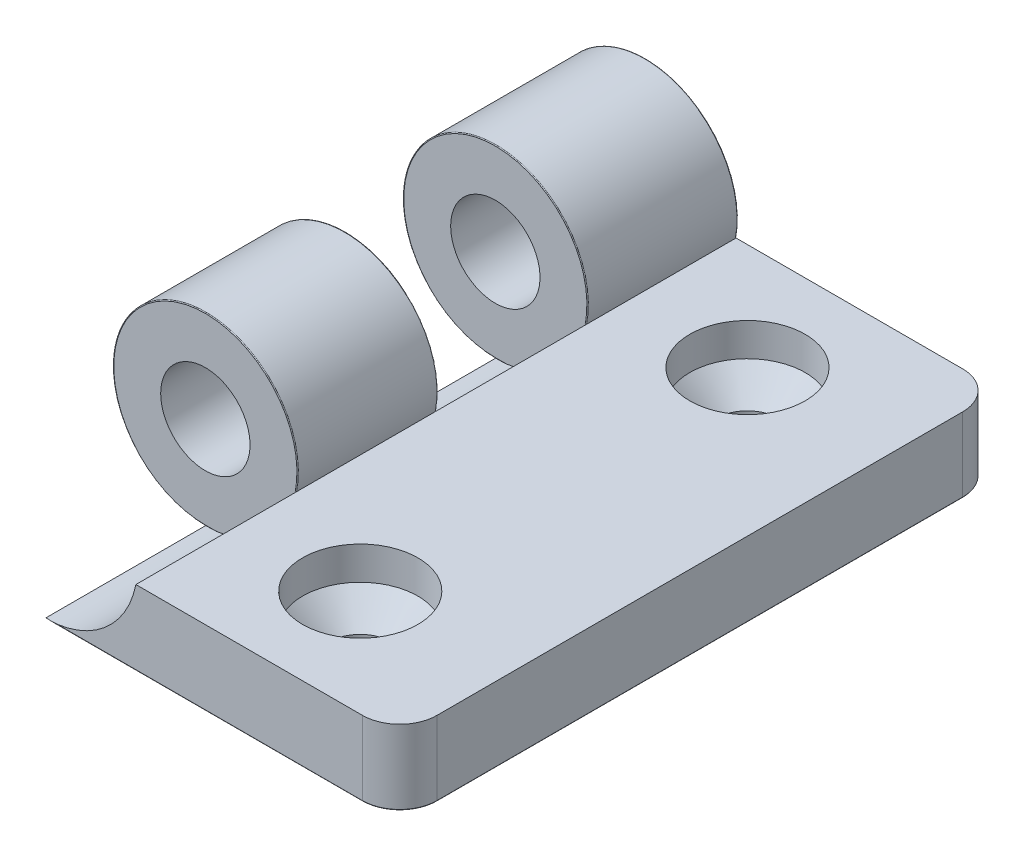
ISO-10303-21;
HEADER;
FILE_DESCRIPTION(('STEP AP214'),'2;1');
FILE_NAME('part.step','',(''),(''),'','','');
FILE_SCHEMA(('AUTOMOTIVE_DESIGN { 1 0 10303 214 1 1 1 1 }'));
ENDSEC;
DATA;
#1=APPLICATION_CONTEXT('core data for automotive mechanical design processes');
#2=APPLICATION_PROTOCOL_DEFINITION('international standard','automotive_design',2000,#1);
#3=PRODUCT_CONTEXT('',#1,'mechanical');
#4=PRODUCT('Part','Part','',(#3));
#5=PRODUCT_RELATED_PRODUCT_CATEGORY('part','',(#4));
#6=PRODUCT_DEFINITION_FORMATION('','',#4);
#7=PRODUCT_DEFINITION_CONTEXT('part definition',#1,'design');
#8=PRODUCT_DEFINITION('design','',#6,#7);
#9=PRODUCT_DEFINITION_SHAPE('','',#8);
#10=(LENGTH_UNIT() NAMED_UNIT(*) SI_UNIT(.MILLI.,.METRE.));
#11=(NAMED_UNIT(*) PLANE_ANGLE_UNIT() SI_UNIT($,.RADIAN.));
#12=(NAMED_UNIT(*) SI_UNIT($,.STERADIAN.) SOLID_ANGLE_UNIT());
#13=UNCERTAINTY_MEASURE_WITH_UNIT(LENGTH_MEASURE(1.E-05),#10,'distance_accuracy_value','');
#14=(GEOMETRIC_REPRESENTATION_CONTEXT(3) GLOBAL_UNCERTAINTY_ASSIGNED_CONTEXT((#13)) GLOBAL_UNIT_ASSIGNED_CONTEXT((#10,
#11,#12)) REPRESENTATION_CONTEXT('',''));
#15=CARTESIAN_POINT('',(0.,0.,0.));
#16=DIRECTION('',(0.,0.,1.));
#17=DIRECTION('',(1.,0.,0.));
#18=AXIS2_PLACEMENT_3D('',#15,#16,#17);
#19=CARTESIAN_POINT('',(0.,0.,40.3));
#20=DIRECTION('',(0.,0.,-1.));
#21=DIRECTION('',(-1.,0.,0.));
#22=AXIS2_PLACEMENT_3D('',#19,#20,#21);
#23=CYLINDRICAL_SURFACE('',#22,6.2);
#24=DIRECTION('',(0.,0.,-1.));
#25=VECTOR('',#24,1.);
#26=CARTESIAN_POINT('',(6.08276253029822,-1.2,40.3));
#27=LINE('',#26,#25);
#28=CARTESIAN_POINT('',(6.08276253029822,-1.2,20.2));
#29=VERTEX_POINT('',#28);
#30=CARTESIAN_POINT('',(6.08276253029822,-1.2,29.5));
#31=VERTEX_POINT('',#30);
#32=EDGE_CURVE('E235',#29,#31,#27,.F.);
#33=ORIENTED_EDGE('',*,*,#32,.F.);
#34=CARTESIAN_POINT('',(0.,0.,20.2));
#35=DIRECTION('',(0.,0.,-1.));
#36=DIRECTION('',(-1.,0.,0.));
#37=AXIS2_PLACEMENT_3D('',#34,#35,#36);
#38=CIRCLE('',#37,6.2);
#39=CARTESIAN_POINT('',(0.,-6.2,20.2));
#40=VERTEX_POINT('',#39);
#41=EDGE_CURVE('E477',#29,#40,#38,.F.);
#42=ORIENTED_EDGE('',*,*,#41,.T.);
#43=DIRECTION('',(0.,0.,-1.));
#44=VECTOR('',#43,1.);
#45=CARTESIAN_POINT('',(0.,-6.2,40.3));
#46=LINE('',#45,#44);
#47=CARTESIAN_POINT('',(0.,-6.2,29.5));
#48=VERTEX_POINT('',#47);
#49=EDGE_CURVE('E236',#48,#40,#46,.T.);
#50=ORIENTED_EDGE('',*,*,#49,.F.);
#51=CARTESIAN_POINT('',(0.,0.,29.5));
#52=DIRECTION('',(0.,0.,-1.));
#53=DIRECTION('',(-1.,0.,0.));
#54=AXIS2_PLACEMENT_3D('',#51,#52,#53);
#55=CIRCLE('',#54,6.2);
#56=EDGE_CURVE('E268',#48,#31,#55,.T.);
#57=ORIENTED_EDGE('',*,*,#56,.T.);
#58=EDGE_LOOP('',(#33,#42,#50,#57));
#59=FACE_BOUND('',#58,.T.);
#60=ADVANCED_FACE('F36',(#59),#23,.T.);
#61=CARTESIAN_POINT('',(0.,0.,40.3));
#62=DIRECTION('',(0.,0.,-1.));
#63=DIRECTION('',(-1.,0.,0.));
#64=AXIS2_PLACEMENT_3D('',#61,#62,#63);
#65=CYLINDRICAL_SURFACE('',#64,3.);
#66=CARTESIAN_POINT('',(0.,0.,29.55));
#67=DIRECTION('',(0.,0.,-1.));
#68=DIRECTION('',(-1.,0.,0.));
#69=AXIS2_PLACEMENT_3D('',#66,#67,#68);
#70=CIRCLE('',#69,3.);
#71=CARTESIAN_POINT('',(-3.,0.,29.55));
#72=VERTEX_POINT('',#71);
#73=EDGE_CURVE('E206',#72,#72,#70,.T.);
#74=ORIENTED_EDGE('',*,*,#73,.F.);
#75=EDGE_LOOP('',(#74));
#76=FACE_BOUND('',#75,.T.);
#77=CARTESIAN_POINT('',(0.,0.,20.15));
#78=DIRECTION('',(0.,0.,-1.));
#79=DIRECTION('',(-1.,0.,0.));
#80=AXIS2_PLACEMENT_3D('',#77,#78,#79);
#81=CIRCLE('',#80,3.);
#82=CARTESIAN_POINT('',(-3.,0.,20.15));
#83=VERTEX_POINT('',#82);
#84=EDGE_CURVE('E201',#83,#83,#81,.T.);
#85=ORIENTED_EDGE('',*,*,#84,.T.);
#86=EDGE_LOOP('',(#85));
#87=FACE_BOUND('',#86,.T.);
#88=ADVANCED_FACE('F409',(#76,#87),#65,.F.);
#89=CARTESIAN_POINT('',(0.,0.,40.3));
#90=DIRECTION('',(0.,0.,1.));
#91=DIRECTION('',(1.,0.,0.));
#92=AXIS2_PLACEMENT_3D('',#89,#90,#91);
#93=PLANE('',#92);
#94=CARTESIAN_POINT('',(0.,0.,40.3));
#95=DIRECTION('',(0.,0.,-1.));
#96=DIRECTION('',(-1.,0.,0.));
#97=AXIS2_PLACEMENT_3D('',#94,#95,#96);
#98=CIRCLE('',#97,6.2);
#99=CARTESIAN_POINT('',(6.08276253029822,-1.2,40.3));
#100=VERTEX_POINT('',#99);
#101=CARTESIAN_POINT('',(0.785811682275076,-6.15,40.3));
#102=VERTEX_POINT('',#101);
#103=EDGE_CURVE('E194',#100,#102,#98,.T.);
#104=ORIENTED_EDGE('',*,*,#103,.T.);
#105=DIRECTION('',(1.,0.,0.));
#106=VECTOR('',#105,1.);
#107=CARTESIAN_POINT('',(21.3,-6.15,40.3));
#108=LINE('',#107,#106);
#109=CARTESIAN_POINT('',(21.3,-6.15,40.3));
#110=VERTEX_POINT('',#109);
#111=EDGE_CURVE('E343',#102,#110,#108,.T.);
#112=ORIENTED_EDGE('',*,*,#111,.T.);
#113=DIRECTION('',(0.,1.,0.));
#114=VECTOR('',#113,1.);
#115=CARTESIAN_POINT('',(21.3,-1.2,40.3));
#116=LINE('',#115,#114);
#117=CARTESIAN_POINT('',(21.3,-1.2,40.3));
#118=VERTEX_POINT('',#117);
#119=EDGE_CURVE('E255',#110,#118,#116,.T.);
#120=ORIENTED_EDGE('',*,*,#119,.T.);
#121=DIRECTION('',(-1.,0.,0.));
#122=VECTOR('',#121,1.);
#123=CARTESIAN_POINT('',(0.,-1.2,40.3));
#124=LINE('',#123,#122);
#125=EDGE_CURVE('E226',#118,#100,#124,.T.);
#126=ORIENTED_EDGE('',*,*,#125,.T.);
#127=EDGE_LOOP('',(#104,#112,#120,#126));
#128=FACE_BOUND('',#127,.T.);
#129=ADVANCED_FACE('F418',(#128),#93,.T.);
#130=CARTESIAN_POINT('',(0.,0.,0.));
#131=DIRECTION('',(0.,0.,1.));
#132=DIRECTION('',(1.,0.,0.));
#133=AXIS2_PLACEMENT_3D('',#130,#131,#132);
#134=PLANE('',#133);
#135=DIRECTION('',(0.,1.,0.));
#136=VECTOR('',#135,1.);
#137=CARTESIAN_POINT('',(21.3,0.,0.));
#138=LINE('',#137,#136);
#139=CARTESIAN_POINT('',(21.3,-1.2,0.));
#140=VERTEX_POINT('',#139);
#141=CARTESIAN_POINT('',(21.3,-6.15,0.));
#142=VERTEX_POINT('',#141);
#143=EDGE_CURVE('E266',#140,#142,#138,.F.);
#144=ORIENTED_EDGE('',*,*,#143,.T.);
#145=DIRECTION('',(1.,0.,0.));
#146=VECTOR('',#145,1.);
#147=CARTESIAN_POINT('',(0.,-6.15,0.));
#148=LINE('',#147,#146);
#149=CARTESIAN_POINT('',(0.,-6.15,0.));
#150=VERTEX_POINT('',#149);
#151=EDGE_CURVE('E60',#142,#150,#148,.F.);
#152=ORIENTED_EDGE('',*,*,#151,.T.);
#153=CARTESIAN_POINT('',(0.,0.,0.));
#154=DIRECTION('',(0.,0.,1.));
#155=DIRECTION('',(1.,0.,0.));
#156=AXIS2_PLACEMENT_3D('',#153,#154,#155);
#157=CIRCLE('',#156,6.15);
#158=CARTESIAN_POINT('',(6.03179077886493,-1.2,0.));
#159=VERTEX_POINT('',#158);
#160=EDGE_CURVE('E445',#150,#159,#157,.F.);
#161=ORIENTED_EDGE('',*,*,#160,.T.);
#162=DIRECTION('',(-1.,0.,0.));
#163=VECTOR('',#162,1.);
#164=CARTESIAN_POINT('',(0.,-1.2,0.));
#165=LINE('',#164,#163);
#166=EDGE_CURVE('E225',#140,#159,#165,.T.);
#167=ORIENTED_EDGE('',*,*,#166,.F.);
#168=EDGE_LOOP('',(#144,#152,#161,#167));
#169=FACE_BOUND('',#168,.T.);
#170=CARTESIAN_POINT('',(0.,0.,0.));
#171=DIRECTION('',(0.,0.,1.));
#172=DIRECTION('',(1.,0.,0.));
#173=AXIS2_PLACEMENT_3D('',#170,#171,#172);
#174=CIRCLE('',#173,3.);
#175=CARTESIAN_POINT('',(3.,0.,0.));
#176=VERTEX_POINT('',#175);
#177=EDGE_CURVE('E240',#176,#176,#174,.T.);
#178=ORIENTED_EDGE('',*,*,#177,.T.);
#179=EDGE_LOOP('',(#178));
#180=FACE_BOUND('',#179,.T.);
#181=ADVANCED_FACE('F426',(#169,#180),#134,.F.);
#182=CARTESIAN_POINT('',(6.08276253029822,-1.2,0.0500000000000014));
#183=VERTEX_POINT('',#182);
#184=CARTESIAN_POINT('',(6.08276253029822,-1.2,10.03));
#185=VERTEX_POINT('',#184);
#186=EDGE_CURVE('E238',#183,#185,#27,.F.);
#187=ORIENTED_EDGE('',*,*,#186,.F.);
#188=CARTESIAN_POINT('',(0.,0.,0.0500000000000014));
#189=DIRECTION('',(0.,0.,1.));
#190=DIRECTION('',(1.,0.,0.));
#191=AXIS2_PLACEMENT_3D('',#188,#189,#190);
#192=CIRCLE('',#191,6.2);
#193=CARTESIAN_POINT('',(0.,-6.2,0.0500000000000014));
#194=VERTEX_POINT('',#193);
#195=EDGE_CURVE('E46',#183,#194,#192,.T.);
#196=ORIENTED_EDGE('',*,*,#195,.T.);
#197=CARTESIAN_POINT('',(0.,-6.2,10.03));
#198=VERTEX_POINT('',#197);
#199=EDGE_CURVE('E232',#198,#194,#46,.T.);
#200=ORIENTED_EDGE('',*,*,#199,.F.);
#201=CARTESIAN_POINT('',(0.,0.,10.03));
#202=DIRECTION('',(0.,0.,-1.));
#203=DIRECTION('',(-1.,0.,0.));
#204=AXIS2_PLACEMENT_3D('',#201,#202,#203);
#205=CIRCLE('',#204,6.2);
#206=EDGE_CURVE('E319',#198,#185,#205,.T.);
#207=ORIENTED_EDGE('',*,*,#206,.T.);
#208=EDGE_LOOP('',(#187,#196,#200,#207));
#209=FACE_BOUND('',#208,.T.);
#210=ADVANCED_FACE('F412',(#209),#23,.T.);
#211=CARTESIAN_POINT('',(0.,0.,10.08));
#212=DIRECTION('',(0.,0.,-1.));
#213=DIRECTION('',(-1.,0.,0.));
#214=AXIS2_PLACEMENT_3D('',#211,#212,#213);
#215=CIRCLE('',#214,3.);
#216=CARTESIAN_POINT('',(-3.,0.,10.08));
#217=VERTEX_POINT('',#216);
#218=EDGE_CURVE('E195',#217,#217,#215,.T.);
#219=ORIENTED_EDGE('',*,*,#218,.F.);
#220=EDGE_LOOP('',(#219));
#221=FACE_BOUND('',#220,.T.);
#222=ORIENTED_EDGE('',*,*,#177,.F.);
#223=EDGE_LOOP('',(#222));
#224=FACE_BOUND('',#223,.T.);
#225=ADVANCED_FACE('F421',(#221,#224),#65,.F.);
#226=CARTESIAN_POINT('',(0.,-1.2,40.3));
#227=DIRECTION('',(0.,-1.,0.));
#228=DIRECTION('',(0.,0.,-1.));
#229=AXIS2_PLACEMENT_3D('',#226,#227,#228);
#230=PLANE('',#229);
#231=CARTESIAN_POINT('',(14.,-1.2,33.15));
#232=DIRECTION('',(0.,1.,0.));
#233=DIRECTION('',(0.,0.,1.));
#234=AXIS2_PLACEMENT_3D('',#231,#232,#233);
#235=CIRCLE('',#234,3.875);
#236=CARTESIAN_POINT('',(14.,-1.2,37.025));
#237=VERTEX_POINT('',#236);
#238=EDGE_CURVE('E219',#237,#237,#235,.T.);
#239=ORIENTED_EDGE('',*,*,#238,.F.);
#240=EDGE_LOOP('',(#239));
#241=FACE_BOUND('',#240,.T.);
#242=CARTESIAN_POINT('',(14.,-1.2,7.15));
#243=DIRECTION('',(0.,1.,0.));
#244=DIRECTION('',(0.,0.,1.));
#245=AXIS2_PLACEMENT_3D('',#242,#243,#244);
#246=CIRCLE('',#245,3.875);
#247=CARTESIAN_POINT('',(14.,-1.2,11.025));
#248=VERTEX_POINT('',#247);
#249=EDGE_CURVE('E222',#248,#248,#246,.T.);
#250=ORIENTED_EDGE('',*,*,#249,.F.);
#251=EDGE_LOOP('',(#250));
#252=FACE_BOUND('',#251,.T.);
#253=DIRECTION('',(0.,0.,-1.));
#254=VECTOR('',#253,1.);
#255=CARTESIAN_POINT('',(23.8,-1.2,40.3));
#256=LINE('',#255,#254);
#257=CARTESIAN_POINT('',(23.8,-1.2,37.8));
#258=VERTEX_POINT('',#257);
#259=CARTESIAN_POINT('',(23.8,-1.2,2.5));
#260=VERTEX_POINT('',#259);
#261=EDGE_CURVE('E229',#258,#260,#256,.T.);
#262=ORIENTED_EDGE('',*,*,#261,.T.);
#263=CARTESIAN_POINT('',(21.3,-1.2,2.5));
#264=DIRECTION('',(0.,-1.,0.));
#265=DIRECTION('',(0.,0.,-1.));
#266=AXIS2_PLACEMENT_3D('',#263,#264,#265);
#267=CIRCLE('',#266,2.5);
#268=EDGE_CURVE('E264',#260,#140,#267,.F.);
#269=ORIENTED_EDGE('',*,*,#268,.T.);
#270=ORIENTED_EDGE('',*,*,#166,.T.);
#271=CARTESIAN_POINT('',(6.03179077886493,-1.2,0.));
#272=CARTESIAN_POINT('',(6.03469958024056,-1.2,-2.20087831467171E-06));
#273=CARTESIAN_POINT('',(6.03760800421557,-1.2,0.000244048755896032));
#274=CARTESIAN_POINT('',(6.04334260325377,-1.2,0.00121770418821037));
#275=CARTESIAN_POINT('',(6.04616879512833,-1.2,0.00194501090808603));
#276=CARTESIAN_POINT('',(6.05166056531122,-1.2,0.00386569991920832));
#277=CARTESIAN_POINT('',(6.05432603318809,-1.2,0.00505939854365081));
#278=CARTESIAN_POINT('',(6.05941543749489,-1.2,0.00788089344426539));
#279=CARTESIAN_POINT('',(6.06183945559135,-1.2,0.00950854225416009));
#280=CARTESIAN_POINT('',(6.06635276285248,-1.2,0.0131378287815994));
#281=CARTESIAN_POINT('',(6.06844491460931,-1.2,0.0151359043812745));
#282=CARTESIAN_POINT('',(6.07225690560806,-1.2,0.0194613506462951));
#283=CARTESIAN_POINT('',(6.07397668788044,-1.2,0.0217887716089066));
#284=CARTESIAN_POINT('',(6.07696092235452,-1.2,0.0266607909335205));
#285=CARTESIAN_POINT('',(6.07823307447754,-1.2,0.0292006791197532));
#286=CARTESIAN_POINT('',(6.08032363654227,-1.2,0.0344597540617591));
#287=CARTESIAN_POINT('',(6.0811424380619,-1.2,0.0371787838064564));
#288=CARTESIAN_POINT('',(6.08206759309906,-1.2,0.0415992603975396));
#289=CARTESIAN_POINT('',(6.0823280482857,-1.2,0.0432699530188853));
#290=CARTESIAN_POINT('',(6.08267546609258,-1.2,0.0466268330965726));
#291=CARTESIAN_POINT('',(6.08276267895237,-1.2,0.0483129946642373));
#292=CARTESIAN_POINT('',(6.08276253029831,-1.2,0.0499999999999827));
#293=B_SPLINE_CURVE_WITH_KNOTS('',3,(#271,#272,#273,#274,#275,#276,#277,#278,#279,#280,#281,
#282,#283,#284,#285,#286,#287,#288,#289,#290,#291,#292),.UNSPECIFIED.,.F.,.F.,(4,2,2,2,2,2,2,2,
2,2,4),(0.,0.00871552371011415,0.0174292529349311,0.0261489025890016,0.0348655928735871,
0.0435024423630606,0.0521406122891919,0.0606219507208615,0.0690959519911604,0.0741603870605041,
0.0792175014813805),.UNSPECIFIED.);
#294=EDGE_CURVE('E11',#159,#183,#293,.T.);
#295=ORIENTED_EDGE('',*,*,#294,.T.);
#296=ORIENTED_EDGE('',*,*,#186,.T.);
#297=CARTESIAN_POINT('',(6.08276253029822,-1.2,10.03));
#298=CARTESIAN_POINT('',(6.08276513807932,-1.2,10.0327743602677));
#299=CARTESIAN_POINT('',(6.08252733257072,-1.2,10.0355476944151));
#300=CARTESIAN_POINT('',(6.08159051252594,-1.2,10.0410117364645));
#301=CARTESIAN_POINT('',(6.08089210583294,-1.2,10.043702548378));
#302=CARTESIAN_POINT('',(6.0790533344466,-1.2,10.0489294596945));
#303=CARTESIAN_POINT('',(6.07791283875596,-1.2,10.0514655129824));
#304=CARTESIAN_POINT('',(6.07522590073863,-1.2,10.0563121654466));
#305=CARTESIAN_POINT('',(6.07367946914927,-1.2,10.058622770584));
#306=CARTESIAN_POINT('',(6.07021241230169,-1.2,10.0629746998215));
#307=CARTESIAN_POINT('',(6.06828882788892,-1.2,10.0650136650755));
#308=CARTESIAN_POINT('',(6.06413169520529,-1.2,10.0687469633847));
#309=CARTESIAN_POINT('',(6.06189807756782,-1.2,10.0704412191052));
#310=CARTESIAN_POINT('',(6.05714176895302,-1.2,10.0734692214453));
#311=CARTESIAN_POINT('',(6.05461458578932,-1.2,10.0747959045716));
#312=CARTESIAN_POINT('',(6.04937629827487,-1.2,10.0770139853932));
#313=CARTESIAN_POINT('',(6.04666525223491,-1.2,10.077905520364));
#314=CARTESIAN_POINT('',(6.04191818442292,-1.2,10.0790443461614));
#315=CARTESIAN_POINT('',(6.03990799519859,-1.2,10.0794025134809));
#316=CARTESIAN_POINT('',(6.03586235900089,-1.2,10.0798803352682));
#317=CARTESIAN_POINT('',(6.03382695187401,-1.2,10.0800003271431));
#318=CARTESIAN_POINT('',(6.03179077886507,-1.2,10.0800000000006));
#319=B_SPLINE_CURVE_WITH_KNOTS('',3,(#297,#298,#299,#300,#301,#302,#303,#304,#305,#306,#307,
#308,#309,#310,#311,#312,#313,#314,#315,#316,#317,#318),.UNSPECIFIED.,.F.,.F.,(4,2,2,2,2,2,2,2,
2,2,4),(0.,0.00831137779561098,0.0166118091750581,0.0249147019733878,0.0332173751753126,
0.0415880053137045,0.049960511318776,0.0584842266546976,0.0670052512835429,0.0731174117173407,
0.0792209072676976),.UNSPECIFIED.);
#320=CARTESIAN_POINT('',(6.03179077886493,-1.2,10.08));
#321=VERTEX_POINT('',#320);
#322=EDGE_CURVE('E344',#185,#321,#319,.T.);
#323=ORIENTED_EDGE('',*,*,#322,.T.);
#324=DIRECTION('',(-1.,0.,0.));
#325=VECTOR('',#324,1.);
#326=CARTESIAN_POINT('',(0.,-1.2,10.08));
#327=LINE('',#326,#325);
#328=CARTESIAN_POINT('',(6.08276253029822,-1.2,10.08));
#329=VERTEX_POINT('',#328);
#330=EDGE_CURVE('E192',#329,#321,#327,.T.);
#331=ORIENTED_EDGE('',*,*,#330,.F.);
#332=DIRECTION('',(0.,0.,1.));
#333=VECTOR('',#332,1.);
#334=CARTESIAN_POINT('',(6.08276253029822,-1.2,10.08));
#335=LINE('',#334,#333);
#336=CARTESIAN_POINT('',(6.08276253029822,-1.2,20.15));
#337=VERTEX_POINT('',#336);
#338=EDGE_CURVE('E183',#337,#329,#335,.F.);
#339=ORIENTED_EDGE('',*,*,#338,.F.);
#340=DIRECTION('',(1.,0.,0.));
#341=VECTOR('',#340,1.);
#342=CARTESIAN_POINT('',(0.,-1.2,20.15));
#343=LINE('',#342,#341);
#344=CARTESIAN_POINT('',(6.03179077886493,-1.2,20.15));
#345=VERTEX_POINT('',#344);
#346=EDGE_CURVE('E167',#345,#337,#343,.T.);
#347=ORIENTED_EDGE('',*,*,#346,.F.);
#348=CARTESIAN_POINT('',(6.03179077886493,-1.2,20.15));
#349=CARTESIAN_POINT('',(6.03469958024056,-1.2,20.1499977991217));
#350=CARTESIAN_POINT('',(6.03760800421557,-1.2,20.1502440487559));
#351=CARTESIAN_POINT('',(6.04334260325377,-1.2,20.1512177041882));
#352=CARTESIAN_POINT('',(6.04616879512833,-1.2,20.1519450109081));
#353=CARTESIAN_POINT('',(6.05166056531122,-1.2,20.1538656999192));
#354=CARTESIAN_POINT('',(6.05432603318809,-1.2,20.1550593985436));
#355=CARTESIAN_POINT('',(6.05941543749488,-1.2,20.1578808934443));
#356=CARTESIAN_POINT('',(6.06183945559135,-1.2,20.1595085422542));
#357=CARTESIAN_POINT('',(6.06635276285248,-1.2,20.1631378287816));
#358=CARTESIAN_POINT('',(6.0684449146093,-1.2,20.1651359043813));
#359=CARTESIAN_POINT('',(6.07225690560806,-1.2,20.1694613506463));
#360=CARTESIAN_POINT('',(6.07397668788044,-1.2,20.1717887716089));
#361=CARTESIAN_POINT('',(6.07696092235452,-1.2,20.1766607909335));
#362=CARTESIAN_POINT('',(6.07823307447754,-1.2,20.1792006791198));
#363=CARTESIAN_POINT('',(6.08032363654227,-1.2,20.1844597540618));
#364=CARTESIAN_POINT('',(6.0811424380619,-1.2,20.1871787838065));
#365=CARTESIAN_POINT('',(6.08206759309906,-1.2,20.1915992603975));
#366=CARTESIAN_POINT('',(6.0823280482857,-1.2,20.1932699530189));
#367=CARTESIAN_POINT('',(6.08267546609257,-1.2,20.1966268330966));
#368=CARTESIAN_POINT('',(6.08276267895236,-1.2,20.1983129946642));
#369=CARTESIAN_POINT('',(6.08276253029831,-1.2,20.2));
#370=B_SPLINE_CURVE_WITH_KNOTS('',3,(#348,#349,#350,#351,#352,#353,#354,#355,#356,#357,#358,
#359,#360,#361,#362,#363,#364,#365,#366,#367,#368,#369),.UNSPECIFIED.,.F.,.F.,(4,2,2,2,2,2,2,2,
2,2,4),(0.,0.00871552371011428,0.0174292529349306,0.0261489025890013,0.0348655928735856,
0.0435024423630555,0.0521406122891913,0.0606219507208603,0.0690959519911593,0.0741603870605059,
0.0792175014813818),.UNSPECIFIED.);
#371=EDGE_CURVE('E320',#345,#29,#370,.T.);
#372=ORIENTED_EDGE('',*,*,#371,.T.);
#373=ORIENTED_EDGE('',*,*,#32,.T.);
#374=CARTESIAN_POINT('',(6.08276253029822,-1.2,29.5));
#375=CARTESIAN_POINT('',(6.08276513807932,-1.2,29.5027743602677));
#376=CARTESIAN_POINT('',(6.08252733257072,-1.2,29.5055476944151));
#377=CARTESIAN_POINT('',(6.08159051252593,-1.2,29.5110117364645));
#378=CARTESIAN_POINT('',(6.08089210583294,-1.2,29.513702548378));
#379=CARTESIAN_POINT('',(6.0790533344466,-1.2,29.5189294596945));
#380=CARTESIAN_POINT('',(6.07791283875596,-1.2,29.5214655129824));
#381=CARTESIAN_POINT('',(6.07522590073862,-1.2,29.5263121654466));
#382=CARTESIAN_POINT('',(6.07367946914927,-1.2,29.528622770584));
#383=CARTESIAN_POINT('',(6.07021241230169,-1.2,29.5329746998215));
#384=CARTESIAN_POINT('',(6.06828882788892,-1.2,29.5350136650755));
#385=CARTESIAN_POINT('',(6.06413169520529,-1.2,29.5387469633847));
#386=CARTESIAN_POINT('',(6.06189807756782,-1.2,29.5404412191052));
#387=CARTESIAN_POINT('',(6.05714176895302,-1.2,29.5434692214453));
#388=CARTESIAN_POINT('',(6.05461458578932,-1.2,29.5447959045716));
#389=CARTESIAN_POINT('',(6.04937629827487,-1.2,29.5470139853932));
#390=CARTESIAN_POINT('',(6.04666525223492,-1.2,29.547905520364));
#391=CARTESIAN_POINT('',(6.04191818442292,-1.2,29.5490443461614));
#392=CARTESIAN_POINT('',(6.03990799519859,-1.2,29.5494025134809));
#393=CARTESIAN_POINT('',(6.03586235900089,-1.2,29.5498803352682));
#394=CARTESIAN_POINT('',(6.033826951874,-1.2,29.5500003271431));
#395=CARTESIAN_POINT('',(6.03179077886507,-1.2,29.5500000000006));
#396=B_SPLINE_CURVE_WITH_KNOTS('',3,(#374,#375,#376,#377,#378,#379,#380,#381,#382,#383,#384,
#385,#386,#387,#388,#389,#390,#391,#392,#393,#394,#395),.UNSPECIFIED.,.F.,.F.,(4,2,2,2,2,2,2,2,
2,2,4),(0.,0.00831137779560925,0.016611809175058,0.0249147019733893,0.0332173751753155,
0.0415880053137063,0.0499605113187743,0.058484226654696,0.0670052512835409,0.0731174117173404,
0.0792209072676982),.UNSPECIFIED.);
#397=CARTESIAN_POINT('',(6.03179077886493,-1.2,29.55));
#398=VERTEX_POINT('',#397);
#399=EDGE_CURVE('E279',#31,#398,#396,.T.);
#400=ORIENTED_EDGE('',*,*,#399,.T.);
#401=DIRECTION('',(-1.,0.,0.));
#402=VECTOR('',#401,1.);
#403=CARTESIAN_POINT('',(0.,-1.2,29.55));
#404=LINE('',#403,#402);
#405=CARTESIAN_POINT('',(6.08276253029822,-1.2,29.55));
#406=VERTEX_POINT('',#405);
#407=EDGE_CURVE('E276',#406,#398,#404,.T.);
#408=ORIENTED_EDGE('',*,*,#407,.F.);
#409=DIRECTION('',(0.,0.,1.));
#410=VECTOR('',#409,1.);
#411=CARTESIAN_POINT('',(6.08276253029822,-1.2,29.55));
#412=LINE('',#411,#410);
#413=EDGE_CURVE('E210',#100,#406,#412,.F.);
#414=ORIENTED_EDGE('',*,*,#413,.F.);
#415=ORIENTED_EDGE('',*,*,#125,.F.);
#416=CARTESIAN_POINT('',(21.3,-1.2,37.8));
#417=DIRECTION('',(0.,-1.,0.));
#418=DIRECTION('',(0.,0.,-1.));
#419=AXIS2_PLACEMENT_3D('',#416,#417,#418);
#420=CIRCLE('',#419,2.5);
#421=EDGE_CURVE('E257',#118,#258,#420,.F.);
#422=ORIENTED_EDGE('',*,*,#421,.T.);
#423=EDGE_LOOP('',(#262,#269,#270,#295,#296,#323,#331,#339,#347,#372,#373,#400,#408,#414,#415,#422));
#424=FACE_BOUND('',#423,.T.);
#425=ADVANCED_FACE('F190',(#241,#252,#424),#230,.F.);
#426=CARTESIAN_POINT('',(0.,-6.2,40.3));
#427=DIRECTION('',(0.,1.,0.));
#428=DIRECTION('',(0.,0.,1.));
#429=AXIS2_PLACEMENT_3D('',#426,#427,#428);
#430=PLANE('',#429);
#431=CARTESIAN_POINT('',(14.,-6.2,7.15));
#432=DIRECTION('',(0.,1.,0.));
#433=DIRECTION('',(0.,0.,1.));
#434=AXIS2_PLACEMENT_3D('',#431,#432,#433);
#435=CIRCLE('',#434,2.1);
#436=CARTESIAN_POINT('',(14.,-6.2,9.25));
#437=VERTEX_POINT('',#436);
#438=EDGE_CURVE('E213',#437,#437,#435,.T.);
#439=ORIENTED_EDGE('',*,*,#438,.T.);
#440=EDGE_LOOP('',(#439));
#441=FACE_BOUND('',#440,.T.);
#442=CARTESIAN_POINT('',(14.,-6.2,33.15));
#443=DIRECTION('',(0.,1.,0.));
#444=DIRECTION('',(0.,0.,1.));
#445=AXIS2_PLACEMENT_3D('',#442,#443,#444);
#446=CIRCLE('',#445,2.1);
#447=CARTESIAN_POINT('',(14.,-6.2,35.25));
#448=VERTEX_POINT('',#447);
#449=EDGE_CURVE('E216',#448,#448,#446,.T.);
#450=ORIENTED_EDGE('',*,*,#449,.T.);
#451=EDGE_LOOP('',(#450));
#452=FACE_BOUND('',#451,.T.);
#453=CARTESIAN_POINT('',(21.3,-6.2,37.8));
#454=DIRECTION('',(0.,1.,0.));
#455=DIRECTION('',(0.,0.,1.));
#456=AXIS2_PLACEMENT_3D('',#453,#454,#455);
#457=CIRCLE('',#456,2.45);
#458=CARTESIAN_POINT('',(23.75,-6.2,37.8));
#459=VERTEX_POINT('',#458);
#460=CARTESIAN_POINT('',(21.3,-6.2,40.25));
#461=VERTEX_POINT('',#460);
#462=EDGE_CURVE('E521',#459,#461,#457,.F.);
#463=ORIENTED_EDGE('',*,*,#462,.T.);
#464=DIRECTION('',(1.,0.,0.));
#465=VECTOR('',#464,1.);
#466=CARTESIAN_POINT('',(0.,-6.2,40.25));
#467=LINE('',#466,#465);
#468=CARTESIAN_POINT('',(0.,-6.2,40.25));
#469=VERTEX_POINT('',#468);
#470=EDGE_CURVE('E375',#461,#469,#467,.F.);
#471=ORIENTED_EDGE('',*,*,#470,.T.);
#472=EDGE_CURVE('E233',#469,#48,#46,.T.);
#473=ORIENTED_EDGE('',*,*,#472,.T.);
#474=ORIENTED_EDGE('',*,*,#49,.T.);
#475=EDGE_CURVE('E237',#40,#198,#46,.T.);
#476=ORIENTED_EDGE('',*,*,#475,.T.);
#477=ORIENTED_EDGE('',*,*,#199,.T.);
#478=DIRECTION('',(1.,0.,0.));
#479=VECTOR('',#478,1.);
#480=CARTESIAN_POINT('',(0.,-6.2,0.0500000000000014));
#481=LINE('',#480,#479);
#482=CARTESIAN_POINT('',(21.3,-6.2,0.0500000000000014));
#483=VERTEX_POINT('',#482);
#484=EDGE_CURVE('E530',#194,#483,#481,.T.);
#485=ORIENTED_EDGE('',*,*,#484,.T.);
#486=CARTESIAN_POINT('',(21.3,-6.2,2.5));
#487=DIRECTION('',(0.,1.,0.));
#488=DIRECTION('',(0.,0.,1.));
#489=AXIS2_PLACEMENT_3D('',#486,#487,#488);
#490=CIRCLE('',#489,2.45);
#491=CARTESIAN_POINT('',(23.75,-6.2,2.5));
#492=VERTEX_POINT('',#491);
#493=EDGE_CURVE('E528',#483,#492,#490,.F.);
#494=ORIENTED_EDGE('',*,*,#493,.T.);
#495=DIRECTION('',(0.,0.,-1.));
#496=VECTOR('',#495,1.);
#497=CARTESIAN_POINT('',(23.75,-6.2,40.3));
#498=LINE('',#497,#496);
#499=EDGE_CURVE('E525',#492,#459,#498,.F.);
#500=ORIENTED_EDGE('',*,*,#499,.T.);
#501=EDGE_LOOP('',(#463,#471,#473,#474,#476,#477,#485,#494,#500));
#502=FACE_BOUND('',#501,.T.);
#503=ADVANCED_FACE('F405',(#441,#452,#502),#430,.F.);
#504=CARTESIAN_POINT('',(23.8,-6.2,40.3));
#505=DIRECTION('',(-1.,0.,0.));
#506=DIRECTION('',(0.,0.,1.));
#507=AXIS2_PLACEMENT_3D('',#504,#505,#506);
#508=PLANE('',#507);
#509=DIRECTION('',(0.,1.,0.));
#510=VECTOR('',#509,1.);
#511=CARTESIAN_POINT('',(23.8,-6.2,37.8));
#512=LINE('',#511,#510);
#513=CARTESIAN_POINT('',(23.8,-6.15,37.8));
#514=VERTEX_POINT('',#513);
#515=EDGE_CURVE('E259',#258,#514,#512,.F.);
#516=ORIENTED_EDGE('',*,*,#515,.T.);
#517=DIRECTION('',(0.,0.,-1.));
#518=VECTOR('',#517,1.);
#519=CARTESIAN_POINT('',(23.8,-6.15,40.3));
#520=LINE('',#519,#518);
#521=CARTESIAN_POINT('',(23.8,-6.15,2.5));
#522=VERTEX_POINT('',#521);
#523=EDGE_CURVE('E509',#514,#522,#520,.T.);
#524=ORIENTED_EDGE('',*,*,#523,.T.);
#525=DIRECTION('',(0.,1.,0.));
#526=VECTOR('',#525,1.);
#527=CARTESIAN_POINT('',(23.8,-6.2,2.5));
#528=LINE('',#527,#526);
#529=EDGE_CURVE('E262',#522,#260,#528,.T.);
#530=ORIENTED_EDGE('',*,*,#529,.T.);
#531=ORIENTED_EDGE('',*,*,#261,.F.);
#532=EDGE_LOOP('',(#516,#524,#530,#531));
#533=FACE_BOUND('',#532,.T.);
#534=ADVANCED_FACE('F399',(#533),#508,.F.);
#535=CARTESIAN_POINT('',(14.,-3.2,7.15));
#536=DIRECTION('',(0.,1.,0.));
#537=DIRECTION('',(0.,0.,1.));
#538=AXIS2_PLACEMENT_3D('',#535,#536,#537);
#539=CYLINDRICAL_SURFACE('',#538,3.875);
#540=CARTESIAN_POINT('',(14.,-3.42500000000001,7.15));
#541=DIRECTION('',(0.,1.,0.));
#542=DIRECTION('',(0.,0.,1.));
#543=AXIS2_PLACEMENT_3D('',#540,#541,#542);
#544=CIRCLE('',#543,3.875);
#545=CARTESIAN_POINT('',(14.,-3.42500000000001,11.025));
#546=VERTEX_POINT('',#545);
#547=EDGE_CURVE('E252',#546,#546,#544,.F.);
#548=ORIENTED_EDGE('',*,*,#547,.T.);
#549=EDGE_LOOP('',(#548));
#550=FACE_BOUND('',#549,.T.);
#551=ORIENTED_EDGE('',*,*,#249,.T.);
#552=EDGE_LOOP('',(#551));
#553=FACE_BOUND('',#552,.T.);
#554=ADVANCED_FACE('F396',(#550,#553),#539,.F.);
#555=CARTESIAN_POINT('',(14.,-3.2,33.15));
#556=DIRECTION('',(0.,1.,0.));
#557=DIRECTION('',(0.,0.,1.));
#558=AXIS2_PLACEMENT_3D('',#555,#556,#557);
#559=CYLINDRICAL_SURFACE('',#558,3.875);
#560=CARTESIAN_POINT('',(14.,-3.42500000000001,33.15));
#561=DIRECTION('',(0.,1.,0.));
#562=DIRECTION('',(0.,0.,1.));
#563=AXIS2_PLACEMENT_3D('',#560,#561,#562);
#564=CIRCLE('',#563,3.875);
#565=CARTESIAN_POINT('',(14.,-3.42500000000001,37.025));
#566=VERTEX_POINT('',#565);
#567=EDGE_CURVE('E246',#566,#566,#564,.F.);
#568=ORIENTED_EDGE('',*,*,#567,.T.);
#569=EDGE_LOOP('',(#568));
#570=FACE_BOUND('',#569,.T.);
#571=ORIENTED_EDGE('',*,*,#238,.T.);
#572=EDGE_LOOP('',(#571));
#573=FACE_BOUND('',#572,.T.);
#574=ADVANCED_FACE('F393',(#570,#573),#559,.F.);
#575=CARTESIAN_POINT('',(14.,-6.2,33.15));
#576=DIRECTION('',(0.,1.,0.));
#577=DIRECTION('',(0.,0.,1.));
#578=AXIS2_PLACEMENT_3D('',#575,#576,#577);
#579=CYLINDRICAL_SURFACE('',#578,2.1);
#580=CARTESIAN_POINT('',(14.,-5.20000000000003,33.15));
#581=DIRECTION('',(0.,1.,0.));
#582=DIRECTION('',(0.,0.,1.));
#583=AXIS2_PLACEMENT_3D('',#580,#581,#582);
#584=CIRCLE('',#583,2.1);
#585=CARTESIAN_POINT('',(14.,-5.20000000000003,35.25));
#586=VERTEX_POINT('',#585);
#587=EDGE_CURVE('E243',#586,#586,#584,.T.);
#588=ORIENTED_EDGE('',*,*,#587,.T.);
#589=EDGE_LOOP('',(#588));
#590=FACE_BOUND('',#589,.T.);
#591=ORIENTED_EDGE('',*,*,#449,.F.);
#592=EDGE_LOOP('',(#591));
#593=FACE_BOUND('',#592,.T.);
#594=ADVANCED_FACE('F389',(#590,#593),#579,.F.);
#595=CARTESIAN_POINT('',(14.,-6.2,7.15));
#596=DIRECTION('',(0.,1.,0.));
#597=DIRECTION('',(0.,0.,1.));
#598=AXIS2_PLACEMENT_3D('',#595,#596,#597);
#599=CYLINDRICAL_SURFACE('',#598,2.1);
#600=CARTESIAN_POINT('',(14.,-5.20000000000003,7.15));
#601=DIRECTION('',(0.,1.,0.));
#602=DIRECTION('',(0.,0.,1.));
#603=AXIS2_PLACEMENT_3D('',#600,#601,#602);
#604=CIRCLE('',#603,2.1);
#605=CARTESIAN_POINT('',(14.,-5.20000000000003,9.25));
#606=VERTEX_POINT('',#605);
#607=EDGE_CURVE('E249',#606,#606,#604,.T.);
#608=ORIENTED_EDGE('',*,*,#607,.T.);
#609=EDGE_LOOP('',(#608));
#610=FACE_BOUND('',#609,.T.);
#611=ORIENTED_EDGE('',*,*,#438,.F.);
#612=EDGE_LOOP('',(#611));
#613=FACE_BOUND('',#612,.T.);
#614=ADVANCED_FACE('F384',(#610,#613),#599,.F.);
#615=CARTESIAN_POINT('',(14.,-5.20000000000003,33.15));
#616=DIRECTION('',(0.,1.,0.));
#617=DIRECTION('',(0.,0.,1.));
#618=AXIS2_PLACEMENT_3D('',#615,#616,#617);
#619=CONICAL_SURFACE('',#618,2.1,0.785398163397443);
#620=ORIENTED_EDGE('',*,*,#567,.F.);
#621=EDGE_LOOP('',(#620));
#622=FACE_BOUND('',#621,.T.);
#623=ORIENTED_EDGE('',*,*,#587,.F.);
#624=EDGE_LOOP('',(#623));
#625=FACE_BOUND('',#624,.T.);
#626=ADVANCED_FACE('F388',(#622,#625),#619,.F.);
#627=CARTESIAN_POINT('',(14.,-5.20000000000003,7.15));
#628=DIRECTION('',(0.,1.,0.));
#629=DIRECTION('',(0.,0.,1.));
#630=AXIS2_PLACEMENT_3D('',#627,#628,#629);
#631=CONICAL_SURFACE('',#630,2.1,0.785398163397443);
#632=ORIENTED_EDGE('',*,*,#547,.F.);
#633=EDGE_LOOP('',(#632));
#634=FACE_BOUND('',#633,.T.);
#635=ORIENTED_EDGE('',*,*,#607,.F.);
#636=EDGE_LOOP('',(#635));
#637=FACE_BOUND('',#636,.T.);
#638=ADVANCED_FACE('F628',(#634,#637),#631,.F.);
#639=CARTESIAN_POINT('',(21.3,0.,37.8));
#640=DIRECTION('',(0.,-1.,0.));
#641=DIRECTION('',(0.,0.,-1.));
#642=AXIS2_PLACEMENT_3D('',#639,#640,#641);
#643=CYLINDRICAL_SURFACE('',#642,2.5);
#644=ORIENTED_EDGE('',*,*,#119,.F.);
#645=CARTESIAN_POINT('',(21.3,-6.15,37.8));
#646=DIRECTION('',(0.,1.,0.));
#647=DIRECTION('',(0.,0.,1.));
#648=AXIS2_PLACEMENT_3D('',#645,#646,#647);
#649=CIRCLE('',#648,2.5);
#650=EDGE_CURVE('E374',#110,#514,#649,.T.);
#651=ORIENTED_EDGE('',*,*,#650,.T.);
#652=ORIENTED_EDGE('',*,*,#515,.F.);
#653=ORIENTED_EDGE('',*,*,#421,.F.);
#654=EDGE_LOOP('',(#644,#651,#652,#653));
#655=FACE_BOUND('',#654,.T.);
#656=ADVANCED_FACE('F504',(#655),#643,.T.);
#657=CARTESIAN_POINT('',(21.3,-6.2,2.5));
#658=DIRECTION('',(0.,1.,0.));
#659=DIRECTION('',(0.,0.,1.));
#660=AXIS2_PLACEMENT_3D('',#657,#658,#659);
#661=CYLINDRICAL_SURFACE('',#660,2.5);
#662=ORIENTED_EDGE('',*,*,#529,.F.);
#663=CARTESIAN_POINT('',(21.3,-6.15,2.5));
#664=DIRECTION('',(0.,1.,0.));
#665=DIRECTION('',(0.,0.,1.));
#666=AXIS2_PLACEMENT_3D('',#663,#664,#665);
#667=CIRCLE('',#666,2.5);
#668=EDGE_CURVE('E514',#522,#142,#667,.T.);
#669=ORIENTED_EDGE('',*,*,#668,.T.);
#670=ORIENTED_EDGE('',*,*,#143,.F.);
#671=ORIENTED_EDGE('',*,*,#268,.F.);
#672=EDGE_LOOP('',(#662,#669,#670,#671));
#673=FACE_BOUND('',#672,.T.);
#674=ADVANCED_FACE('F382',(#673),#661,.T.);
#675=CARTESIAN_POINT('',(0.,0.,29.55));
#676=DIRECTION('',(0.,0.,1.));
#677=DIRECTION('',(1.,0.,0.));
#678=AXIS2_PLACEMENT_3D('',#675,#676,#677);
#679=CYLINDRICAL_SURFACE('',#678,6.2);
#680=ORIENTED_EDGE('',*,*,#472,.F.);
#681=CARTESIAN_POINT('',(0.785811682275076,-6.15,40.3));
#682=CARTESIAN_POINT('',(0.769275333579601,-6.15211291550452,40.2999994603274));
#683=CARTESIAN_POINT('',(0.752731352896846,-6.15415902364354,40.2998668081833));
#684=CARTESIAN_POINT('',(0.719631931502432,-6.15811722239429,40.2993768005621));
#685=CARTESIAN_POINT('',(0.703076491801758,-6.16002932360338,40.2990194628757));
#686=CARTESIAN_POINT('',(0.620210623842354,-6.16926163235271,40.2967680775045));
#687=CARTESIAN_POINT('',(0.553822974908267,-6.17557415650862,40.293482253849));
#688=CARTESIAN_POINT('',(0.420975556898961,-6.18605064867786,40.2852729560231));
#689=CARTESIAN_POINT('',(0.354515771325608,-6.19021391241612,40.2803489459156));
#690=CARTESIAN_POINT('',(0.197271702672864,-6.19752684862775,40.2676790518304));
#691=CARTESIAN_POINT('',(0.106471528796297,-6.19975049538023,40.2595594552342));
#692=CARTESIAN_POINT('',(0.0104565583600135,-6.1999933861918,40.2509389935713));
#693=CARTESIAN_POINT('',(0.00522825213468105,-6.19999999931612,40.2504694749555));
#694=CARTESIAN_POINT('',(0.,-6.2,40.25));
#695=B_SPLINE_CURVE_WITH_KNOTS('',3,(#681,#682,#683,#684,#685,#686,#687,#688,#689,#690,#691,
#692,#693,#694),.UNSPECIFIED.,.F.,.F.,(4,2,2,2,2,2,4),(0.,0.0500102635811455,0.10001656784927,
0.300231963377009,0.500512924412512,0.77396629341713,0.789714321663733),.UNSPECIFIED.);
#696=EDGE_CURVE('E368',#469,#102,#695,.F.);
#697=ORIENTED_EDGE('',*,*,#696,.T.);
#698=ORIENTED_EDGE('',*,*,#103,.F.);
#699=ORIENTED_EDGE('',*,*,#413,.T.);
#700=CARTESIAN_POINT('',(0.,0.,29.55));
#701=DIRECTION('',(0.,0.,-1.));
#702=DIRECTION('',(-1.,0.,0.));
#703=AXIS2_PLACEMENT_3D('',#700,#701,#702);
#704=CIRCLE('',#703,6.2);
#705=CARTESIAN_POINT('',(0.785811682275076,-6.15,29.55));
#706=VERTEX_POINT('',#705);
#707=EDGE_CURVE('E198',#406,#706,#704,.T.);
#708=ORIENTED_EDGE('',*,*,#707,.T.);
#709=CARTESIAN_POINT('',(0.785811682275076,-6.15,29.55));
#710=CARTESIAN_POINT('',(0.769275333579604,-6.15211291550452,29.5499994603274));
#711=CARTESIAN_POINT('',(0.752731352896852,-6.15415902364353,29.5498668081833));
#712=CARTESIAN_POINT('',(0.719631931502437,-6.15811722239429,29.5493768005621));
#713=CARTESIAN_POINT('',(0.703076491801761,-6.16002932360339,29.5490194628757));
#714=CARTESIAN_POINT('',(0.620210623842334,-6.16926163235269,29.5467680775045));
#715=CARTESIAN_POINT('',(0.553822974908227,-6.17557415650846,29.543482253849));
#716=CARTESIAN_POINT('',(0.420975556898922,-6.18605064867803,29.5352729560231));
#717=CARTESIAN_POINT('',(0.354515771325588,-6.19021391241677,29.5303489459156));
#718=CARTESIAN_POINT('',(0.197271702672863,-6.19752684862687,29.5176790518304));
#719=CARTESIAN_POINT('',(0.106471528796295,-6.19975049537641,29.5095594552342));
#720=CARTESIAN_POINT('',(0.0104565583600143,-6.19999338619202,29.5009389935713));
#721=CARTESIAN_POINT('',(0.00522825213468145,-6.19999999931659,29.5004694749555));
#722=CARTESIAN_POINT('',(0.,-6.20000000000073,29.5));
#723=B_SPLINE_CURVE_WITH_KNOTS('',3,(#709,#710,#711,#712,#713,#714,#715,#716,#717,#718,#719,
#720,#721,#722),.UNSPECIFIED.,.F.,.F.,(4,2,2,2,2,2,4),(0.,0.0500102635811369,0.100016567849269,
0.300231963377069,0.500512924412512,0.773966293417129,0.789714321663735),.UNSPECIFIED.);
#724=EDGE_CURVE('E177',#706,#48,#723,.T.);
#725=ORIENTED_EDGE('',*,*,#724,.T.);
#726=EDGE_LOOP('',(#680,#697,#698,#699,#708,#725));
#727=FACE_BOUND('',#726,.T.);
#728=ADVANCED_FACE('F378',(#727),#679,.F.);
#729=CARTESIAN_POINT('',(0.,0.,29.55));
#730=DIRECTION('',(0.,0.,-1.));
#731=DIRECTION('',(-1.,0.,0.));
#732=AXIS2_PLACEMENT_3D('',#729,#730,#731);
#733=PLANE('',#732);
#734=ORIENTED_EDGE('',*,*,#73,.T.);
#735=EDGE_LOOP('',(#734));
#736=FACE_BOUND('',#735,.T.);
#737=ORIENTED_EDGE('',*,*,#707,.F.);
#738=ORIENTED_EDGE('',*,*,#407,.T.);
#739=CARTESIAN_POINT('',(0.,0.,29.55));
#740=DIRECTION('',(0.,0.,-1.));
#741=DIRECTION('',(-1.,0.,0.));
#742=AXIS2_PLACEMENT_3D('',#739,#740,#741);
#743=CIRCLE('',#742,6.15);
#744=CARTESIAN_POINT('',(0.,-6.15,29.55));
#745=VERTEX_POINT('',#744);
#746=EDGE_CURVE('E274',#398,#745,#743,.F.);
#747=ORIENTED_EDGE('',*,*,#746,.T.);
#748=DIRECTION('',(-1.,0.,0.));
#749=VECTOR('',#748,1.);
#750=CARTESIAN_POINT('',(0.,-6.15,29.55));
#751=LINE('',#750,#749);
#752=EDGE_CURVE('E271',#745,#706,#751,.F.);
#753=ORIENTED_EDGE('',*,*,#752,.T.);
#754=EDGE_LOOP('',(#737,#738,#747,#753));
#755=FACE_BOUND('',#754,.T.);
#756=ADVANCED_FACE('F332',(#736,#755),#733,.F.);
#757=CARTESIAN_POINT('',(0.,0.,10.08));
#758=DIRECTION('',(0.,0.,1.));
#759=DIRECTION('',(1.,0.,0.));
#760=AXIS2_PLACEMENT_3D('',#757,#758,#759);
#761=CYLINDRICAL_SURFACE('',#760,6.2);
#762=ORIENTED_EDGE('',*,*,#338,.T.);
#763=CARTESIAN_POINT('',(0.,0.,10.08));
#764=DIRECTION('',(0.,0.,-1.));
#765=DIRECTION('',(-1.,0.,0.));
#766=AXIS2_PLACEMENT_3D('',#763,#764,#765);
#767=CIRCLE('',#766,6.2);
#768=CARTESIAN_POINT('',(0.785811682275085,-6.15,10.08));
#769=VERTEX_POINT('',#768);
#770=EDGE_CURVE('E186',#329,#769,#767,.T.);
#771=ORIENTED_EDGE('',*,*,#770,.T.);
#772=CARTESIAN_POINT('',(0.785811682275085,-6.15,10.08));
#773=CARTESIAN_POINT('',(0.76927533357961,-6.15211291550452,10.0799994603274));
#774=CARTESIAN_POINT('',(0.752731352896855,-6.15415902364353,10.0798668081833));
#775=CARTESIAN_POINT('',(0.71963193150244,-6.15811722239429,10.0793768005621));
#776=CARTESIAN_POINT('',(0.703076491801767,-6.16002932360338,10.0790194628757));
#777=CARTESIAN_POINT('',(0.620210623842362,-6.16926163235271,10.0767680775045));
#778=CARTESIAN_POINT('',(0.553822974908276,-6.17557415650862,10.073482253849));
#779=CARTESIAN_POINT('',(0.420975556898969,-6.18605064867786,10.0652729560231));
#780=CARTESIAN_POINT('',(0.354515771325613,-6.19021391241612,10.0603489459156));
#781=CARTESIAN_POINT('',(0.197271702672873,-6.19752684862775,10.0476790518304));
#782=CARTESIAN_POINT('',(0.106471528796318,-6.19975049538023,10.039559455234));
#783=CARTESIAN_POINT('',(0.0104565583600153,-6.1999933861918,10.0309389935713));
#784=CARTESIAN_POINT('',(0.00522825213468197,-6.19999999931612,10.0304694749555));
#785=CARTESIAN_POINT('',(0.,-6.2,10.03));
#786=B_SPLINE_CURVE_WITH_KNOTS('',3,(#772,#773,#774,#775,#776,#777,#778,#779,#780,#781,#782,
#783,#784,#785),.UNSPECIFIED.,.F.,.F.,(4,2,2,2,2,2,4),(0.,0.0500102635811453,0.10001656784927,
0.300231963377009,0.500512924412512,0.773966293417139,0.789714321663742),.UNSPECIFIED.);
#787=EDGE_CURVE('E336',#769,#198,#786,.T.);
#788=ORIENTED_EDGE('',*,*,#787,.T.);
#789=ORIENTED_EDGE('',*,*,#475,.F.);
#790=CARTESIAN_POINT('',(0.785811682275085,-6.15,20.15));
#791=CARTESIAN_POINT('',(0.769275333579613,-6.15211291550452,20.1500005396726));
#792=CARTESIAN_POINT('',(0.752731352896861,-6.15415902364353,20.1501331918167));
#793=CARTESIAN_POINT('',(0.719631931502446,-6.15811722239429,20.1506231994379));
#794=CARTESIAN_POINT('',(0.70307649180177,-6.16002932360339,20.1509805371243));
#795=CARTESIAN_POINT('',(0.620210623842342,-6.16926163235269,20.1532319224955));
#796=CARTESIAN_POINT('',(0.553822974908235,-6.17557415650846,20.156517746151));
#797=CARTESIAN_POINT('',(0.420975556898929,-6.18605064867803,20.1647270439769));
#798=CARTESIAN_POINT('',(0.354515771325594,-6.19021391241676,20.1696510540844));
#799=CARTESIAN_POINT('',(0.197271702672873,-6.19752684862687,20.1823209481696));
#800=CARTESIAN_POINT('',(0.106471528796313,-6.19975049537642,20.190440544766));
#801=CARTESIAN_POINT('',(0.010456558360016,-6.19999338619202,20.1990610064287));
#802=CARTESIAN_POINT('',(0.00522825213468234,-6.19999999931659,20.1995305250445));
#803=CARTESIAN_POINT('',(0.,-6.20000000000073,20.2));
#804=B_SPLINE_CURVE_WITH_KNOTS('',3,(#790,#791,#792,#793,#794,#795,#796,#797,#798,#799,#800,
#801,#802,#803),.UNSPECIFIED.,.F.,.F.,(4,2,2,2,2,2,4),(0.,0.0500102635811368,0.10001656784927,
0.30023196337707,0.500512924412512,0.773966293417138,0.789714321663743),.UNSPECIFIED.);
#805=CARTESIAN_POINT('',(0.785811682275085,-6.15,20.15));
#806=VERTEX_POINT('',#805);
#807=EDGE_CURVE('E185',#40,#806,#804,.F.);
#808=ORIENTED_EDGE('',*,*,#807,.T.);
#809=CARTESIAN_POINT('',(0.,0.,20.15));
#810=DIRECTION('',(0.,0.,-1.));
#811=DIRECTION('',(-1.,0.,0.));
#812=AXIS2_PLACEMENT_3D('',#809,#810,#811);
#813=CIRCLE('',#812,6.2);
#814=EDGE_CURVE('E171',#337,#806,#813,.T.);
#815=ORIENTED_EDGE('',*,*,#814,.F.);
#816=EDGE_LOOP('',(#762,#771,#788,#789,#808,#815));
#817=FACE_BOUND('',#816,.T.);
#818=ADVANCED_FACE('F181',(#817),#761,.F.);
#819=CARTESIAN_POINT('',(0.,0.,10.08));
#820=DIRECTION('',(0.,0.,-1.));
#821=DIRECTION('',(-1.,0.,0.));
#822=AXIS2_PLACEMENT_3D('',#819,#820,#821);
#823=PLANE('',#822);
#824=ORIENTED_EDGE('',*,*,#218,.T.);
#825=EDGE_LOOP('',(#824));
#826=FACE_BOUND('',#825,.T.);
#827=ORIENTED_EDGE('',*,*,#770,.F.);
#828=ORIENTED_EDGE('',*,*,#330,.T.);
#829=CARTESIAN_POINT('',(0.,0.,10.08));
#830=DIRECTION('',(0.,0.,-1.));
#831=DIRECTION('',(-1.,0.,0.));
#832=AXIS2_PLACEMENT_3D('',#829,#830,#831);
#833=CIRCLE('',#832,6.15);
#834=CARTESIAN_POINT('',(0.,-6.15,10.08));
#835=VERTEX_POINT('',#834);
#836=EDGE_CURVE('E539',#321,#835,#833,.F.);
#837=ORIENTED_EDGE('',*,*,#836,.T.);
#838=DIRECTION('',(-1.,0.,0.));
#839=VECTOR('',#838,1.);
#840=CARTESIAN_POINT('',(0.,-6.15,10.08));
#841=LINE('',#840,#839);
#842=EDGE_CURVE('E537',#835,#769,#841,.F.);
#843=ORIENTED_EDGE('',*,*,#842,.T.);
#844=EDGE_LOOP('',(#827,#828,#837,#843));
#845=FACE_BOUND('',#844,.T.);
#846=ADVANCED_FACE('F331',(#826,#845),#823,.F.);
#847=CARTESIAN_POINT('',(0.,0.,20.15));
#848=DIRECTION('',(0.,0.,-1.));
#849=DIRECTION('',(-1.,0.,0.));
#850=AXIS2_PLACEMENT_3D('',#847,#848,#849);
#851=PLANE('',#850);
#852=ORIENTED_EDGE('',*,*,#84,.F.);
#853=EDGE_LOOP('',(#852));
#854=FACE_BOUND('',#853,.T.);
#855=ORIENTED_EDGE('',*,*,#814,.T.);
#856=DIRECTION('',(-1.,0.,0.));
#857=VECTOR('',#856,1.);
#858=CARTESIAN_POINT('',(6.08276253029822,-6.15,20.15));
#859=LINE('',#858,#857);
#860=CARTESIAN_POINT('',(0.,-6.15,20.15));
#861=VERTEX_POINT('',#860);
#862=EDGE_CURVE('E476',#806,#861,#859,.T.);
#863=ORIENTED_EDGE('',*,*,#862,.T.);
#864=CARTESIAN_POINT('',(0.,0.,20.15));
#865=DIRECTION('',(0.,0.,-1.));
#866=DIRECTION('',(-1.,0.,0.));
#867=AXIS2_PLACEMENT_3D('',#864,#865,#866);
#868=CIRCLE('',#867,6.15);
#869=EDGE_CURVE('E174',#861,#345,#868,.T.);
#870=ORIENTED_EDGE('',*,*,#869,.T.);
#871=ORIENTED_EDGE('',*,*,#346,.T.);
#872=EDGE_LOOP('',(#855,#863,#870,#871));
#873=FACE_BOUND('',#872,.T.);
#874=ADVANCED_FACE('F169',(#854,#873),#851,.T.);
#875=CARTESIAN_POINT('',(0.,0.,29.5));
#876=DIRECTION('',(0.,0.,-1.));
#877=DIRECTION('',(-1.,0.,0.));
#878=AXIS2_PLACEMENT_3D('',#875,#876,#877);
#879=TOROIDAL_SURFACE('',#878,6.15,0.05);
#880=ORIENTED_EDGE('',*,*,#399,.F.);
#881=ORIENTED_EDGE('',*,*,#56,.F.);
#882=CARTESIAN_POINT('',(0.,-6.15,29.5));
#883=DIRECTION('',(1.,0.,0.));
#884=DIRECTION('',(0.,0.,-1.));
#885=AXIS2_PLACEMENT_3D('',#882,#883,#884);
#886=CIRCLE('',#885,0.05);
#887=EDGE_CURVE('E187',#745,#48,#886,.T.);
#888=ORIENTED_EDGE('',*,*,#887,.F.);
#889=ORIENTED_EDGE('',*,*,#746,.F.);
#890=EDGE_LOOP('',(#880,#881,#888,#889));
#891=FACE_BOUND('',#890,.T.);
#892=ADVANCED_FACE('F295',(#891),#879,.T.);
#893=CARTESIAN_POINT('',(0.,-6.15,29.5));
#894=DIRECTION('',(-1.,0.,0.));
#895=DIRECTION('',(0.,0.,1.));
#896=AXIS2_PLACEMENT_3D('',#893,#894,#895);
#897=CYLINDRICAL_SURFACE('',#896,0.05);
#898=ORIENTED_EDGE('',*,*,#724,.F.);
#899=ORIENTED_EDGE('',*,*,#752,.F.);
#900=ORIENTED_EDGE('',*,*,#887,.T.);
#901=EDGE_LOOP('',(#898,#899,#900));
#902=FACE_BOUND('',#901,.T.);
#903=ADVANCED_FACE('F299',(#902),#897,.T.);
#904=CARTESIAN_POINT('',(0.,0.,20.2));
#905=DIRECTION('',(0.,0.,-1.));
#906=DIRECTION('',(-1.,0.,0.));
#907=AXIS2_PLACEMENT_3D('',#904,#905,#906);
#908=TOROIDAL_SURFACE('',#907,6.15,0.05);
#909=ORIENTED_EDGE('',*,*,#371,.F.);
#910=ORIENTED_EDGE('',*,*,#869,.F.);
#911=CARTESIAN_POINT('',(0.,-6.15,20.2));
#912=DIRECTION('',(1.,0.,0.));
#913=DIRECTION('',(0.,0.,-1.));
#914=AXIS2_PLACEMENT_3D('',#911,#912,#913);
#915=CIRCLE('',#914,0.05);
#916=EDGE_CURVE('E325',#40,#861,#915,.T.);
#917=ORIENTED_EDGE('',*,*,#916,.F.);
#918=ORIENTED_EDGE('',*,*,#41,.F.);
#919=EDGE_LOOP('',(#909,#910,#917,#918));
#920=FACE_BOUND('',#919,.T.);
#921=ADVANCED_FACE('F308',(#920),#908,.T.);
#922=CARTESIAN_POINT('',(0.,-6.15,20.2));
#923=DIRECTION('',(1.,0.,0.));
#924=DIRECTION('',(0.,0.,-1.));
#925=AXIS2_PLACEMENT_3D('',#922,#923,#924);
#926=CYLINDRICAL_SURFACE('',#925,0.05);
#927=ORIENTED_EDGE('',*,*,#862,.F.);
#928=ORIENTED_EDGE('',*,*,#807,.F.);
#929=ORIENTED_EDGE('',*,*,#916,.T.);
#930=EDGE_LOOP('',(#927,#928,#929));
#931=FACE_BOUND('',#930,.T.);
#932=ADVANCED_FACE('F303',(#931),#926,.T.);
#933=CARTESIAN_POINT('',(0.,0.,10.03));
#934=DIRECTION('',(0.,0.,-1.));
#935=DIRECTION('',(-1.,0.,0.));
#936=AXIS2_PLACEMENT_3D('',#933,#934,#935);
#937=TOROIDAL_SURFACE('',#936,6.15,0.05);
#938=ORIENTED_EDGE('',*,*,#322,.F.);
#939=ORIENTED_EDGE('',*,*,#206,.F.);
#940=CARTESIAN_POINT('',(0.,-6.15,10.03));
#941=DIRECTION('',(1.,0.,0.));
#942=DIRECTION('',(0.,0.,-1.));
#943=AXIS2_PLACEMENT_3D('',#940,#941,#942);
#944=CIRCLE('',#943,0.05);
#945=EDGE_CURVE('E350',#835,#198,#944,.T.);
#946=ORIENTED_EDGE('',*,*,#945,.F.);
#947=ORIENTED_EDGE('',*,*,#836,.F.);
#948=EDGE_LOOP('',(#938,#939,#946,#947));
#949=FACE_BOUND('',#948,.T.);
#950=ADVANCED_FACE('F307',(#949),#937,.T.);
#951=CARTESIAN_POINT('',(0.,-6.15,10.03));
#952=DIRECTION('',(-1.,0.,0.));
#953=DIRECTION('',(0.,0.,1.));
#954=AXIS2_PLACEMENT_3D('',#951,#952,#953);
#955=CYLINDRICAL_SURFACE('',#954,0.05);
#956=ORIENTED_EDGE('',*,*,#787,.F.);
#957=ORIENTED_EDGE('',*,*,#842,.F.);
#958=ORIENTED_EDGE('',*,*,#945,.T.);
#959=EDGE_LOOP('',(#956,#957,#958));
#960=FACE_BOUND('',#959,.T.);
#961=ADVANCED_FACE('F352',(#960),#955,.T.);
#962=CARTESIAN_POINT('',(0.,0.,0.0500000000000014));
#963=DIRECTION('',(0.,0.,1.));
#964=DIRECTION('',(1.,0.,0.));
#965=AXIS2_PLACEMENT_3D('',#962,#963,#964);
#966=TOROIDAL_SURFACE('',#965,6.15,0.05);
#967=ORIENTED_EDGE('',*,*,#294,.F.);
#968=ORIENTED_EDGE('',*,*,#160,.F.);
#969=CARTESIAN_POINT('',(0.,-6.15,0.0500000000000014));
#970=DIRECTION('',(1.,0.,0.));
#971=DIRECTION('',(0.,0.,-1.));
#972=AXIS2_PLACEMENT_3D('',#969,#970,#971);
#973=CIRCLE('',#972,0.05);
#974=EDGE_CURVE('E41',#194,#150,#973,.T.);
#975=ORIENTED_EDGE('',*,*,#974,.F.);
#976=ORIENTED_EDGE('',*,*,#195,.F.);
#977=EDGE_LOOP('',(#967,#968,#975,#976));
#978=FACE_BOUND('',#977,.T.);
#979=ADVANCED_FACE('F38',(#978),#966,.T.);
#980=CARTESIAN_POINT('',(0.,-6.15,0.0500000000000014));
#981=DIRECTION('',(1.,0.,0.));
#982=DIRECTION('',(0.,0.,-1.));
#983=AXIS2_PLACEMENT_3D('',#980,#981,#982);
#984=CYLINDRICAL_SURFACE('',#983,0.05);
#985=ORIENTED_EDGE('',*,*,#974,.T.);
#986=ORIENTED_EDGE('',*,*,#151,.F.);
#987=CARTESIAN_POINT('',(21.3,-6.15,0.0500000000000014));
#988=DIRECTION('',(1.,0.,0.));
#989=DIRECTION('',(0.,0.,-1.));
#990=AXIS2_PLACEMENT_3D('',#987,#988,#989);
#991=CIRCLE('',#990,0.05);
#992=EDGE_CURVE('E459',#483,#142,#991,.T.);
#993=ORIENTED_EDGE('',*,*,#992,.F.);
#994=ORIENTED_EDGE('',*,*,#484,.F.);
#995=EDGE_LOOP('',(#985,#986,#993,#994));
#996=FACE_BOUND('',#995,.T.);
#997=ADVANCED_FACE('F645',(#996),#984,.T.);
#998=CARTESIAN_POINT('',(21.3,-6.15,2.5));
#999=DIRECTION('',(0.,1.,0.));
#1000=DIRECTION('',(0.,0.,1.));
#1001=AXIS2_PLACEMENT_3D('',#998,#999,#1000);
#1002=TOROIDAL_SURFACE('',#1001,2.45,0.05);
#1003=ORIENTED_EDGE('',*,*,#992,.T.);
#1004=ORIENTED_EDGE('',*,*,#668,.F.);
#1005=CARTESIAN_POINT('',(23.75,-6.15,2.5));
#1006=DIRECTION('',(0.,0.,1.));
#1007=DIRECTION('',(1.,0.,0.));
#1008=AXIS2_PLACEMENT_3D('',#1005,#1006,#1007);
#1009=CIRCLE('',#1008,0.05);
#1010=EDGE_CURVE('E457',#492,#522,#1009,.T.);
#1011=ORIENTED_EDGE('',*,*,#1010,.F.);
#1012=ORIENTED_EDGE('',*,*,#493,.F.);
#1013=EDGE_LOOP('',(#1003,#1004,#1011,#1012));
#1014=FACE_BOUND('',#1013,.T.);
#1015=ADVANCED_FACE('F527',(#1014),#1002,.T.);
#1016=CARTESIAN_POINT('',(23.75,-6.15,40.3));
#1017=DIRECTION('',(0.,0.,-1.));
#1018=DIRECTION('',(-1.,0.,0.));
#1019=AXIS2_PLACEMENT_3D('',#1016,#1017,#1018);
#1020=CYLINDRICAL_SURFACE('',#1019,0.05);
#1021=ORIENTED_EDGE('',*,*,#1010,.T.);
#1022=ORIENTED_EDGE('',*,*,#523,.F.);
#1023=CARTESIAN_POINT('',(23.75,-6.15,37.8));
#1024=DIRECTION('',(0.,0.,1.));
#1025=DIRECTION('',(1.,0.,0.));
#1026=AXIS2_PLACEMENT_3D('',#1023,#1024,#1025);
#1027=CIRCLE('',#1026,0.05);
#1028=EDGE_CURVE('E454',#459,#514,#1027,.T.);
#1029=ORIENTED_EDGE('',*,*,#1028,.F.);
#1030=ORIENTED_EDGE('',*,*,#499,.F.);
#1031=EDGE_LOOP('',(#1021,#1022,#1029,#1030));
#1032=FACE_BOUND('',#1031,.T.);
#1033=ADVANCED_FACE('F524',(#1032),#1020,.T.);
#1034=CARTESIAN_POINT('',(21.3,-6.15,37.8));
#1035=DIRECTION('',(0.,1.,0.));
#1036=DIRECTION('',(0.,0.,1.));
#1037=AXIS2_PLACEMENT_3D('',#1034,#1035,#1036);
#1038=TOROIDAL_SURFACE('',#1037,2.45,0.05);
#1039=ORIENTED_EDGE('',*,*,#1028,.T.);
#1040=ORIENTED_EDGE('',*,*,#650,.F.);
#1041=CARTESIAN_POINT('',(21.3,-6.15,40.25));
#1042=DIRECTION('',(-1.,0.,0.));
#1043=DIRECTION('',(0.,0.,1.));
#1044=AXIS2_PLACEMENT_3D('',#1041,#1042,#1043);
#1045=CIRCLE('',#1044,0.05);
#1046=EDGE_CURVE('E452',#461,#110,#1045,.T.);
#1047=ORIENTED_EDGE('',*,*,#1046,.F.);
#1048=ORIENTED_EDGE('',*,*,#462,.F.);
#1049=EDGE_LOOP('',(#1039,#1040,#1047,#1048));
#1050=FACE_BOUND('',#1049,.T.);
#1051=ADVANCED_FACE('F364',(#1050),#1038,.T.);
#1052=CARTESIAN_POINT('',(0.,-6.15,40.25));
#1053=DIRECTION('',(-1.,0.,0.));
#1054=DIRECTION('',(0.,0.,1.));
#1055=AXIS2_PLACEMENT_3D('',#1052,#1053,#1054);
#1056=CYLINDRICAL_SURFACE('',#1055,0.05);
#1057=ORIENTED_EDGE('',*,*,#696,.F.);
#1058=ORIENTED_EDGE('',*,*,#470,.F.);
#1059=ORIENTED_EDGE('',*,*,#1046,.T.);
#1060=ORIENTED_EDGE('',*,*,#111,.F.);
#1061=EDGE_LOOP('',(#1057,#1058,#1059,#1060));
#1062=FACE_BOUND('',#1061,.T.);
#1063=ADVANCED_FACE('F360',(#1062),#1056,.T.);
#1064=CLOSED_SHELL('',(#60,#88,#129,#181,#210,#225,#425,#503,#534,#554,#574,#594,#614,#626,#638,
#656,#674,#728,#756,#818,#846,#874,#892,#903,#921,#932,#950,#961,#979,#997,#1015,#1033,#1051,#1063));
#1065=MANIFOLD_SOLID_BREP('B2',#1064);
#1066=ADVANCED_BREP_SHAPE_REPRESENTATION('',(#18,#1065),#14);
#1067=SHAPE_DEFINITION_REPRESENTATION(#9,#1066);
ENDSEC;
END-ISO-10303-21;
